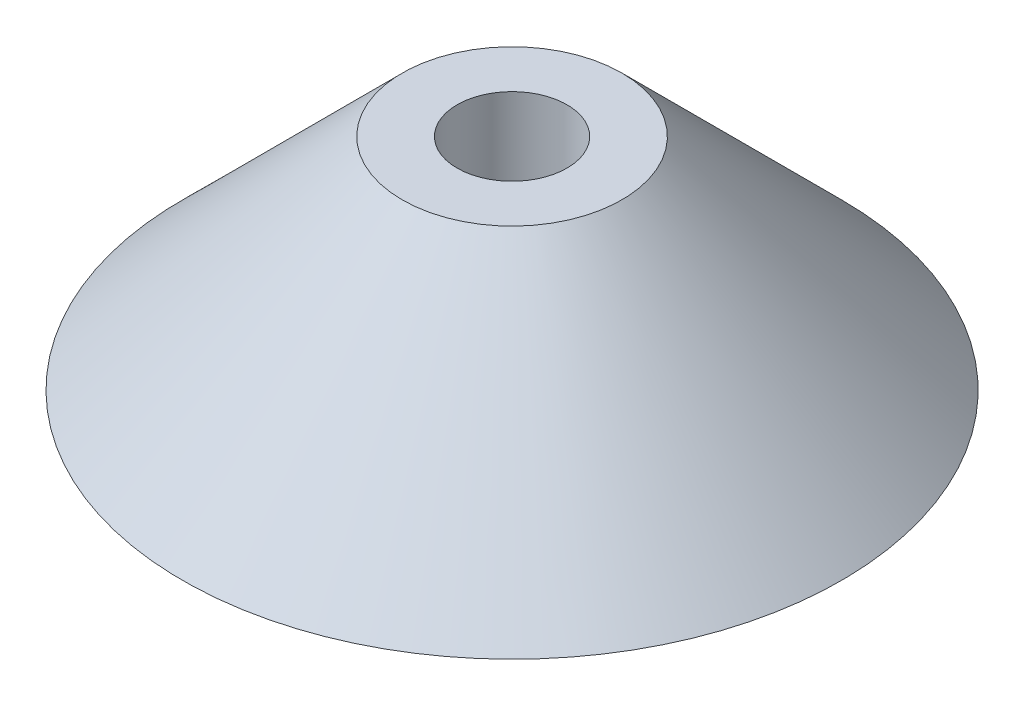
ISO-10303-21;
HEADER;
FILE_DESCRIPTION(('STEP AP214'),'2;1');
FILE_NAME('part.step','',(''),(''),'','','');
FILE_SCHEMA(('AUTOMOTIVE_DESIGN { 1 0 10303 214 1 1 1 1 }'));
ENDSEC;
DATA;
#1=APPLICATION_CONTEXT('core data for automotive mechanical design processes');
#2=APPLICATION_PROTOCOL_DEFINITION('international standard','automotive_design',2000,#1);
#3=PRODUCT_CONTEXT('',#1,'mechanical');
#4=PRODUCT('Part','Part','',(#3));
#5=PRODUCT_RELATED_PRODUCT_CATEGORY('part','',(#4));
#6=PRODUCT_DEFINITION_FORMATION('','',#4);
#7=PRODUCT_DEFINITION_CONTEXT('part definition',#1,'design');
#8=PRODUCT_DEFINITION('design','',#6,#7);
#9=PRODUCT_DEFINITION_SHAPE('','',#8);
#10=(LENGTH_UNIT() NAMED_UNIT(*) SI_UNIT(.MILLI.,.METRE.));
#11=(NAMED_UNIT(*) PLANE_ANGLE_UNIT() SI_UNIT($,.RADIAN.));
#12=(NAMED_UNIT(*) SI_UNIT($,.STERADIAN.) SOLID_ANGLE_UNIT());
#13=UNCERTAINTY_MEASURE_WITH_UNIT(LENGTH_MEASURE(1.E-05),#10,'distance_accuracy_value','');
#14=(GEOMETRIC_REPRESENTATION_CONTEXT(3) GLOBAL_UNCERTAINTY_ASSIGNED_CONTEXT((#13)) GLOBAL_UNIT_ASSIGNED_CONTEXT((#10,
#11,#12)) REPRESENTATION_CONTEXT('',''));
#15=CARTESIAN_POINT('',(0.,0.,0.));
#16=DIRECTION('',(0.,0.,1.));
#17=DIRECTION('',(1.,0.,0.));
#18=AXIS2_PLACEMENT_3D('',#15,#16,#17);
#19=CARTESIAN_POINT('',(0.,0.,0.));
#20=DIRECTION('',(0.,-1.,0.));
#21=DIRECTION('',(0.,0.,-1.));
#22=AXIS2_PLACEMENT_3D('',#19,#20,#21);
#23=PLANE('',#22);
#24=CARTESIAN_POINT('',(0.,0.,0.));
#25=DIRECTION('',(0.,-1.,0.));
#26=DIRECTION('',(0.,0.,-1.));
#27=AXIS2_PLACEMENT_3D('',#24,#25,#26);
#28=CIRCLE('',#27,4.99999999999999);
#29=CARTESIAN_POINT('',(0.,0.,-4.99999999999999));
#30=VERTEX_POINT('',#29);
#31=EDGE_CURVE('E49',#30,#30,#28,.T.);
#32=ORIENTED_EDGE('',*,*,#31,.F.);
#33=EDGE_LOOP('',(#32));
#34=FACE_BOUND('',#33,.T.);
#35=CARTESIAN_POINT('',(0.,0.,0.));
#36=DIRECTION('',(0.,1.,0.));
#37=DIRECTION('',(0.,0.,1.));
#38=AXIS2_PLACEMENT_3D('',#35,#36,#37);
#39=CIRCLE('',#38,30.);
#40=CARTESIAN_POINT('',(0.,0.,-30.));
#41=VERTEX_POINT('',#40);
#42=EDGE_CURVE('E10',#41,#41,#39,.T.);
#43=ORIENTED_EDGE('',*,*,#42,.F.);
#44=EDGE_LOOP('',(#43));
#45=FACE_BOUND('',#44,.T.);
#46=ADVANCED_FACE('F39',(#34,#45),#23,.T.);
#47=CARTESIAN_POINT('',(0.,20.,0.));
#48=DIRECTION('',(0.,-1.,0.));
#49=DIRECTION('',(0.,0.,-1.));
#50=AXIS2_PLACEMENT_3D('',#47,#48,#49);
#51=CONICAL_SURFACE('',#50,9.99999999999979,0.785398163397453);
#52=CARTESIAN_POINT('',(0.,20.,0.));
#53=DIRECTION('',(0.,1.,0.));
#54=DIRECTION('',(0.,0.,1.));
#55=AXIS2_PLACEMENT_3D('',#52,#53,#54);
#56=CIRCLE('',#55,9.99999999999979);
#57=CARTESIAN_POINT('',(0.,20.,-9.99999999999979));
#58=VERTEX_POINT('',#57);
#59=EDGE_CURVE('E45',#58,#58,#56,.T.);
#60=CARTESIAN_POINT('',(0.,0.,-30.));
#61=CARTESIAN_POINT('',(0.,0.20833333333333,-29.7916666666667));
#62=CARTESIAN_POINT('',(0.,0.416666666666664,-29.5833333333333));
#63=CARTESIAN_POINT('',(0.,0.833333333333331,-29.1666666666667));
#64=CARTESIAN_POINT('',(0.,1.04166666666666,-28.9583333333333));
#65=CARTESIAN_POINT('',(0.,1.45833333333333,-28.5416666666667));
#66=CARTESIAN_POINT('',(0.,1.66666666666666,-28.3333333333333));
#67=CARTESIAN_POINT('',(0.,2.08333333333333,-27.9166666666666));
#68=CARTESIAN_POINT('',(0.,2.29166666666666,-27.7083333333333));
#69=CARTESIAN_POINT('',(0.,2.70833333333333,-27.2916666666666));
#70=CARTESIAN_POINT('',(0.,2.91666666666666,-27.0833333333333));
#71=CARTESIAN_POINT('',(0.,3.33333333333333,-26.6666666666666));
#72=CARTESIAN_POINT('',(0.,3.54166666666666,-26.4583333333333));
#73=CARTESIAN_POINT('',(0.,3.95833333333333,-26.0416666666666));
#74=CARTESIAN_POINT('',(0.,4.16666666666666,-25.8333333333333));
#75=CARTESIAN_POINT('',(0.,4.58333333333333,-25.4166666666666));
#76=CARTESIAN_POINT('',(0.,4.79166666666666,-25.2083333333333));
#77=CARTESIAN_POINT('',(0.,5.20833333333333,-24.7916666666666));
#78=CARTESIAN_POINT('',(0.,5.41666666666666,-24.5833333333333));
#79=CARTESIAN_POINT('',(0.,5.83333333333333,-24.1666666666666));
#80=CARTESIAN_POINT('',(0.,6.04166666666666,-23.9583333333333));
#81=CARTESIAN_POINT('',(0.,6.45833333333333,-23.5416666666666));
#82=CARTESIAN_POINT('',(0.,6.66666666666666,-23.3333333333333));
#83=CARTESIAN_POINT('',(0.,7.08333333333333,-22.9166666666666));
#84=CARTESIAN_POINT('',(0.,7.29166666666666,-22.7083333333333));
#85=CARTESIAN_POINT('',(0.,7.70833333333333,-22.2916666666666));
#86=CARTESIAN_POINT('',(0.,7.91666666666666,-22.0833333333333));
#87=CARTESIAN_POINT('',(0.,8.33333333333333,-21.6666666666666));
#88=CARTESIAN_POINT('',(0.,8.54166666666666,-21.4583333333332));
#89=CARTESIAN_POINT('',(0.,8.95833333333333,-21.0416666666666));
#90=CARTESIAN_POINT('',(0.,9.16666666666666,-20.8333333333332));
#91=CARTESIAN_POINT('',(0.,9.58333333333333,-20.4166666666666));
#92=CARTESIAN_POINT('',(0.,9.79166666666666,-20.2083333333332));
#93=CARTESIAN_POINT('',(0.,10.2083333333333,-19.7916666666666));
#94=CARTESIAN_POINT('',(0.,10.4166666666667,-19.5833333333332));
#95=CARTESIAN_POINT('',(0.,10.8333333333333,-19.1666666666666));
#96=CARTESIAN_POINT('',(0.,11.0416666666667,-18.9583333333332));
#97=CARTESIAN_POINT('',(0.,11.4583333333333,-18.5416666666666));
#98=CARTESIAN_POINT('',(0.,11.6666666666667,-18.3333333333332));
#99=CARTESIAN_POINT('',(0.,12.0833333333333,-17.9166666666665));
#100=CARTESIAN_POINT('',(0.,12.2916666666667,-17.7083333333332));
#101=CARTESIAN_POINT('',(0.,12.7083333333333,-17.2916666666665));
#102=CARTESIAN_POINT('',(0.,12.9166666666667,-17.0833333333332));
#103=CARTESIAN_POINT('',(0.,13.3333333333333,-16.6666666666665));
#104=CARTESIAN_POINT('',(0.,13.5416666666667,-16.4583333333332));
#105=CARTESIAN_POINT('',(0.,13.9583333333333,-16.0416666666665));
#106=CARTESIAN_POINT('',(0.,14.1666666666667,-15.8333333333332));
#107=CARTESIAN_POINT('',(0.,14.5833333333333,-15.4166666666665));
#108=CARTESIAN_POINT('',(0.,14.7916666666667,-15.2083333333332));
#109=CARTESIAN_POINT('',(0.,15.2083333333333,-14.7916666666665));
#110=CARTESIAN_POINT('',(0.,15.4166666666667,-14.5833333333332));
#111=CARTESIAN_POINT('',(0.,15.8333333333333,-14.1666666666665));
#112=CARTESIAN_POINT('',(0.,16.0416666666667,-13.9583333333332));
#113=CARTESIAN_POINT('',(0.,16.4583333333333,-13.5416666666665));
#114=CARTESIAN_POINT('',(0.,16.6666666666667,-13.3333333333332));
#115=CARTESIAN_POINT('',(0.,17.0833333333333,-12.9166666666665));
#116=CARTESIAN_POINT('',(0.,17.2916666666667,-12.7083333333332));
#117=CARTESIAN_POINT('',(0.,17.7083333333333,-12.2916666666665));
#118=CARTESIAN_POINT('',(0.,17.9166666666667,-12.0833333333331));
#119=CARTESIAN_POINT('',(0.,18.3333333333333,-11.6666666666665));
#120=CARTESIAN_POINT('',(0.,18.5416666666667,-11.4583333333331));
#121=CARTESIAN_POINT('',(0.,18.9583333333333,-11.0416666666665));
#122=CARTESIAN_POINT('',(0.,19.1666666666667,-10.8333333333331));
#123=CARTESIAN_POINT('',(0.,19.5833333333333,-10.4166666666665));
#124=CARTESIAN_POINT('',(0.,19.7916666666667,-10.2083333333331));
#125=CARTESIAN_POINT('',(0.,20.,-9.99999999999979));
#126=B_SPLINE_CURVE_WITH_KNOTS('',3,(#60,#61,#62,#63,#64,#65,#66,#67,#68,#69,#70,#71,#72,#73,
#74,#75,#76,#77,#78,#79,#80,#81,#82,#83,#84,#85,#86,#87,#88,#89,#90,#91,#92,#93,#94,#95,#96,#97,
#98,#99,#100,#101,#102,#103,#104,#105,#106,#107,#108,#109,#110,#111,#112,#113,#114,#115,#116,
#117,#118,#119,#120,#121,#122,#123,#124,#125),.UNSPECIFIED.,.F.,.F.,(4,2,2,2,2,2,2,2,2,2,2,2,2,
2,2,2,2,2,2,2,2,2,2,2,2,2,2,2,2,2,2,2,4),(0.,0.88388347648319,1.76776695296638,2.65165042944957,
3.53553390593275,4.41941738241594,5.30330085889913,6.18718433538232,7.07106781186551,
7.9549512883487,8.83883476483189,9.72271824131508,10.6066017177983,11.4904851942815,
12.3743686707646,13.2582521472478,14.142135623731,15.0260191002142,15.9099025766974,
16.7937860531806,17.6776695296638,18.561553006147,19.4454364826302,20.3293199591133,
21.2132034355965,22.0970869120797,22.9809703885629,23.8648538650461,24.7487373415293,
25.6326208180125,26.5165042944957,27.4003877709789,28.2842712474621),.UNSPECIFIED.);
#127=EDGE_CURVE('BSEAM64',#41,#58,#126,.T.);
#128=ORIENTED_EDGE('',*,*,#42,.T.);
#129=ORIENTED_EDGE('',*,*,#59,.F.);
#130=ORIENTED_EDGE('',*,*,#127,.T.);
#131=ORIENTED_EDGE('',*,*,#127,.F.);
#132=EDGE_LOOP('',(#128,#130,#129,#131));
#133=FACE_BOUND('',#132,.T.);
#134=ADVANCED_FACE('F64',(#133),#51,.T.);
#135=CARTESIAN_POINT('',(0.,20.,0.));
#136=DIRECTION('',(0.,1.,0.));
#137=DIRECTION('',(0.,0.,1.));
#138=AXIS2_PLACEMENT_3D('',#135,#136,#137);
#139=PLANE('',#138);
#140=CARTESIAN_POINT('',(0.,20.,0.));
#141=DIRECTION('',(0.,1.,0.));
#142=DIRECTION('',(0.,0.,1.));
#143=AXIS2_PLACEMENT_3D('',#140,#141,#142);
#144=CIRCLE('',#143,4.99999999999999);
#145=CARTESIAN_POINT('',(0.,20.,4.99999999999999));
#146=VERTEX_POINT('',#145);
#147=EDGE_CURVE('E53',#146,#146,#144,.T.);
#148=ORIENTED_EDGE('',*,*,#147,.F.);
#149=EDGE_LOOP('',(#148));
#150=FACE_BOUND('',#149,.T.);
#151=ORIENTED_EDGE('',*,*,#59,.T.);
#152=EDGE_LOOP('',(#151));
#153=FACE_BOUND('',#152,.T.);
#154=ADVANCED_FACE('F62',(#150,#153),#139,.T.);
#155=CARTESIAN_POINT('',(0.,20.,0.));
#156=DIRECTION('',(0.,1.,0.));
#157=DIRECTION('',(0.,0.,1.));
#158=AXIS2_PLACEMENT_3D('',#155,#156,#157);
#159=CYLINDRICAL_SURFACE('',#158,4.99999999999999);
#160=ORIENTED_EDGE('',*,*,#147,.T.);
#161=EDGE_LOOP('',(#160));
#162=FACE_BOUND('',#161,.T.);
#163=ORIENTED_EDGE('',*,*,#31,.T.);
#164=EDGE_LOOP('',(#163));
#165=FACE_BOUND('',#164,.T.);
#166=ADVANCED_FACE('F59',(#162,#165),#159,.F.);
#167=CLOSED_SHELL('',(#46,#134,#154,#166));
#168=MANIFOLD_SOLID_BREP('B2',#167);
#169=ADVANCED_BREP_SHAPE_REPRESENTATION('',(#18,#168),#14);
#170=SHAPE_DEFINITION_REPRESENTATION(#9,#169);
ENDSEC;
END-ISO-10303-21;
